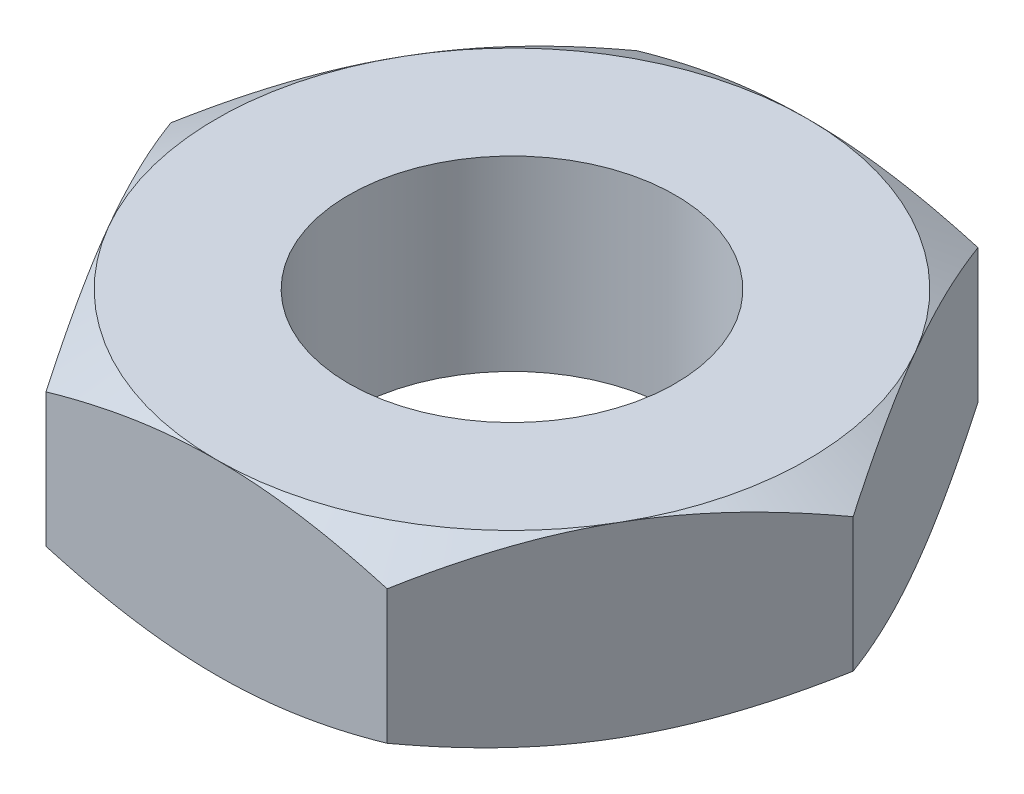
ISO-10303-21;
HEADER;
FILE_DESCRIPTION(('STEP AP214'),'2;1');
FILE_NAME('part.step','',(''),(''),'','','');
FILE_SCHEMA(('AUTOMOTIVE_DESIGN { 1 0 10303 214 1 1 1 1 }'));
ENDSEC;
DATA;
#1=APPLICATION_CONTEXT('core data for automotive mechanical design processes');
#2=APPLICATION_PROTOCOL_DEFINITION('international standard','automotive_design',2000,#1);
#3=PRODUCT_CONTEXT('',#1,'mechanical');
#4=PRODUCT('Part','Part','',(#3));
#5=PRODUCT_RELATED_PRODUCT_CATEGORY('part','',(#4));
#6=PRODUCT_DEFINITION_FORMATION('','',#4);
#7=PRODUCT_DEFINITION_CONTEXT('part definition',#1,'design');
#8=PRODUCT_DEFINITION('design','',#6,#7);
#9=PRODUCT_DEFINITION_SHAPE('','',#8);
#10=(LENGTH_UNIT() NAMED_UNIT(*) SI_UNIT(.MILLI.,.METRE.));
#11=(NAMED_UNIT(*) PLANE_ANGLE_UNIT() SI_UNIT($,.RADIAN.));
#12=(NAMED_UNIT(*) SI_UNIT($,.STERADIAN.) SOLID_ANGLE_UNIT());
#13=UNCERTAINTY_MEASURE_WITH_UNIT(LENGTH_MEASURE(1.E-05),#10,'distance_accuracy_value','');
#14=(GEOMETRIC_REPRESENTATION_CONTEXT(3) GLOBAL_UNCERTAINTY_ASSIGNED_CONTEXT((#13)) GLOBAL_UNIT_ASSIGNED_CONTEXT((#10,
#11,#12)) REPRESENTATION_CONTEXT('',''));
#15=CARTESIAN_POINT('',(0.,0.,0.));
#16=DIRECTION('',(0.,0.,1.));
#17=DIRECTION('',(1.,0.,0.));
#18=AXIS2_PLACEMENT_3D('',#15,#16,#17);
#19=CARTESIAN_POINT('',(-5.48482755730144,6.,9.5));
#20=DIRECTION('',(0.,0.,-1.));
#21=DIRECTION('',(-1.,0.,0.));
#22=AXIS2_PLACEMENT_3D('',#19,#20,#21);
#23=PLANE('',#22);
#24=CARTESIAN_POINT('',(-14.7068937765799,4.62362970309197,9.5));
#25=CARTESIAN_POINT('',(-14.4995501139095,4.52307626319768,9.5));
#26=CARTESIAN_POINT('',(-14.2919624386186,4.42302621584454,9.5));
#27=CARTESIAN_POINT('',(-13.8762481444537,4.2240469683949,9.5));
#28=CARTESIAN_POINT('',(-13.668121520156,4.12511777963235,9.5));
#29=CARTESIAN_POINT('',(-13.0428010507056,3.83015634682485,9.5));
#30=CARTESIAN_POINT('',(-12.6247283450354,3.635980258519,9.5));
#31=CARTESIAN_POINT('',(-11.7834887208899,3.25270589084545,9.5));
#32=CARTESIAN_POINT('',(-11.3603064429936,3.06364124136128,9.5));
#33=CARTESIAN_POINT('',(-10.5105677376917,2.69328067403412,9.5));
#34=CARTESIAN_POINT('',(-10.0840114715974,2.51198438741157,9.5));
#35=CARTESIAN_POINT('',(-9.21316108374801,2.15358539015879,9.5));
#36=CARTESIAN_POINT('',(-8.76873522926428,1.97680100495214,9.5));
#37=CARTESIAN_POINT('',(-7.87467550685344,1.63667478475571,9.5));
#38=CARTESIAN_POINT('',(-7.42504105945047,1.47333446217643,9.5));
#39=CARTESIAN_POINT('',(-6.52069340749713,1.16440435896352,9.5));
#40=CARTESIAN_POINT('',(-6.06599269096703,1.01877841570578,9.5));
#41=CARTESIAN_POINT('',(-5.15008524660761,0.749965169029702,9.5));
#42=CARTESIAN_POINT('',(-4.68888062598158,0.62677077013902,9.5));
#43=CARTESIAN_POINT('',(-3.76219051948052,0.409414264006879,9.5));
#44=CARTESIAN_POINT('',(-3.29674287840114,0.315095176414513,9.5));
#45=CARTESIAN_POINT('',(-2.59435369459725,0.19936734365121,9.5));
#46=CARTESIAN_POINT('',(-2.35950352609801,0.165081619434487,9.5));
#47=CARTESIAN_POINT('',(-1.88864471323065,0.105766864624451,9.5));
#48=CARTESIAN_POINT('',(-1.65263618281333,0.0807369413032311,9.5));
#49=CARTESIAN_POINT('',(-1.18284814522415,0.0407449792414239,9.5));
#50=CARTESIAN_POINT('',(-0.949079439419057,0.0256565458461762,9.5));
#51=CARTESIAN_POINT('',(-0.481113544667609,0.005376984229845,9.5));
#52=CARTESIAN_POINT('',(-0.24691636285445,0.000185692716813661,9.5));
#53=CARTESIAN_POINT('',(0.221488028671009,-0.000175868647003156,9.5));
#54=CARTESIAN_POINT('',(0.455695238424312,0.00465390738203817,9.5));
#55=CARTESIAN_POINT('',(0.923698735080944,0.0242170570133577,9.5));
#56=CARTESIAN_POINT('',(1.1574950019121,0.0389509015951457,9.5));
#57=CARTESIAN_POINT('',(1.72018105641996,0.086018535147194,9.5));
#58=CARTESIAN_POINT('',(2.04868096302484,0.123095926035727,9.5));
#59=CARTESIAN_POINT('',(2.70322743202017,0.214777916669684,9.5));
#60=CARTESIAN_POINT('',(3.02927365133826,0.269384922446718,9.5));
#61=CARTESIAN_POINT('',(3.67860756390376,0.394183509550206,9.5));
#62=CARTESIAN_POINT('',(4.00189287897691,0.46438734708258,9.5));
#63=CARTESIAN_POINT('',(4.64521294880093,0.61823863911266,9.5));
#64=CARTESIAN_POINT('',(4.96524775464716,0.701885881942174,9.5));
#65=CARTESIAN_POINT('',(5.60906657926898,0.882556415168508,9.5));
#66=CARTESIAN_POINT('',(5.9327791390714,0.979832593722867,9.5));
#67=CARTESIAN_POINT('',(6.57701512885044,1.18437377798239,9.5));
#68=CARTESIAN_POINT('',(6.89753853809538,1.29163884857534,9.5));
#69=CARTESIAN_POINT('',(7.53555549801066,1.51446014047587,9.5));
#70=CARTESIAN_POINT('',(7.85305003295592,1.63001355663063,9.5));
#71=CARTESIAN_POINT('',(8.4854126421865,1.86805820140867,9.5));
#72=CARTESIAN_POINT('',(8.80028074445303,1.99054935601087,9.5));
#73=CARTESIAN_POINT('',(9.53172443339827,2.28290021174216,9.5));
#74=CARTESIAN_POINT('',(9.94740386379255,2.4549983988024,9.5));
#75=CARTESIAN_POINT('',(10.7753143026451,2.80732159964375,9.5));
#76=CARTESIAN_POINT('',(11.1875451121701,2.98754707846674,9.5));
#77=CARTESIAN_POINT('',(12.0091844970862,3.35453048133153,9.5));
#78=CARTESIAN_POINT('',(12.4185924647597,3.54128976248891,9.5));
#79=CARTESIAN_POINT('',(13.2349605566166,3.92005059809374,9.5));
#80=CARTESIAN_POINT('',(13.6419207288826,4.11205204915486,9.5));
#81=CARTESIAN_POINT('',(14.454214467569,4.50053660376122,9.5));
#82=CARTESIAN_POINT('',(14.8595458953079,4.69702417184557,9.5));
#83=CARTESIAN_POINT('',(15.6684730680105,5.093538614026,9.5));
#84=CARTESIAN_POINT('',(16.0720688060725,5.29356550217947,9.5));
#85=CARTESIAN_POINT('',(17.2805625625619,5.89798249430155,9.5));
#86=CARTESIAN_POINT('',(18.083267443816,6.3067572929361,9.5));
#87=CARTESIAN_POINT('',(19.6191087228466,7.09890427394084,9.5));
#88=CARTESIAN_POINT('',(20.3525802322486,7.48162959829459,9.5));
#89=CARTESIAN_POINT('',(21.8167718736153,8.25236208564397,9.5));
#90=CARTESIAN_POINT('',(22.5474919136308,8.64036942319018,9.5));
#91=CARTESIAN_POINT('',(24.0050274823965,9.41948379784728,9.5));
#92=CARTESIAN_POINT('',(24.7318481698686,9.81058119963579,9.5));
#93=CARTESIAN_POINT('',(26.1837230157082,10.5959509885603,9.5));
#94=CARTESIAN_POINT('',(26.9087772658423,10.9902232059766,9.5));
#95=CARTESIAN_POINT('',(27.6331779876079,11.3856844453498,9.5));
#96=B_SPLINE_CURVE_WITH_KNOTS('',3,(#24,#25,#26,#27,#28,#29,#30,#31,#32,#33,#34,#35,#36,#37,#38,
#39,#40,#41,#42,#43,#44,#45,#46,#47,#48,#49,#50,#51,#52,#53,#54,#55,#56,#57,#58,#59,#60,#61,#62,
#63,#64,#65,#66,#67,#68,#69,#70,#71,#72,#73,#74,#75,#76,#77,#78,#79,#80,#81,#82,#83,#84,#85,#86,
#87,#88,#89,#90,#91,#92,#93,#94,#95),.UNSPECIFIED.,.F.,.F.,(4,2,2,2,2,2,2,2,2,2,2,2,2,2,2,2,2,2,
2,2,2,2,2,2,2,2,2,2,2,2,2,2,2,2,2,4),(0.,0.69131741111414,1.38264180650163,2.76549653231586,
4.15592398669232,5.54628536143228,6.98100468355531,8.4158851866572,9.84778549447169,
11.279232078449,12.7027524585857,13.414617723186,14.1264143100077,14.8289770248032,
15.5315281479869,16.2340824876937,16.9366702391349,17.9278783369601,18.9192225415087,
19.911348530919,20.9034589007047,21.9173037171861,22.9311551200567,23.9446649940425,
24.9581640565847,26.3077386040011,27.6573904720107,29.0073243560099,30.3572316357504,
31.7085465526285,33.0598668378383,35.7621733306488,38.2441116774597,40.7261322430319,
43.2022154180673,45.678167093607),.UNSPECIFIED.);
#97=CARTESIAN_POINT('',(5.48482755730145,0.848505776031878,9.5));
#98=VERTEX_POINT('',#97);
#99=CARTESIAN_POINT('',(0.,0.,9.5));
#100=VERTEX_POINT('',#99);
#101=EDGE_CURVE('E127',#98,#100,#96,.F.);
#102=ORIENTED_EDGE('',*,*,#101,.F.);
#103=DIRECTION('',(0.,-1.,0.));
#104=VECTOR('',#103,1.);
#105=CARTESIAN_POINT('',(5.48482755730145,6.,9.5));
#106=LINE('',#105,#104);
#107=CARTESIAN_POINT('',(5.48482755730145,5.15149422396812,9.5));
#108=VERTEX_POINT('',#107);
#109=EDGE_CURVE('E262',#108,#98,#106,.T.);
#110=ORIENTED_EDGE('',*,*,#109,.F.);
#111=CARTESIAN_POINT('',(-14.7068937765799,1.37637029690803,9.5));
#112=CARTESIAN_POINT('',(-14.4995501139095,1.47692373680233,9.5));
#113=CARTESIAN_POINT('',(-14.2919624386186,1.57697378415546,9.5));
#114=CARTESIAN_POINT('',(-13.8762481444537,1.7759530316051,9.5));
#115=CARTESIAN_POINT('',(-13.668121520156,1.87488222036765,9.5));
#116=CARTESIAN_POINT('',(-13.0428010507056,2.16984365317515,9.5));
#117=CARTESIAN_POINT('',(-12.6247283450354,2.364019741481,9.5));
#118=CARTESIAN_POINT('',(-11.7834887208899,2.74729410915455,9.5));
#119=CARTESIAN_POINT('',(-11.3603064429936,2.93635875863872,9.5));
#120=CARTESIAN_POINT('',(-10.5105677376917,3.30671932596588,9.5));
#121=CARTESIAN_POINT('',(-10.0840114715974,3.48801561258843,9.5));
#122=CARTESIAN_POINT('',(-9.21316108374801,3.84641460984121,9.5));
#123=CARTESIAN_POINT('',(-8.76873522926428,4.02319899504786,9.5));
#124=CARTESIAN_POINT('',(-7.87467550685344,4.36332521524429,9.5));
#125=CARTESIAN_POINT('',(-7.42504105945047,4.52666553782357,9.5));
#126=CARTESIAN_POINT('',(-6.52069340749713,4.83559564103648,9.5));
#127=CARTESIAN_POINT('',(-6.06599269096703,4.98122158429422,9.5));
#128=CARTESIAN_POINT('',(-5.15008524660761,5.2500348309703,9.5));
#129=CARTESIAN_POINT('',(-4.68888062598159,5.37322922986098,9.5));
#130=CARTESIAN_POINT('',(-3.76219051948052,5.59058573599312,9.5));
#131=CARTESIAN_POINT('',(-3.29674287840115,5.68490482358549,9.5));
#132=CARTESIAN_POINT('',(-2.59435369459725,5.80063265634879,9.5));
#133=CARTESIAN_POINT('',(-2.35950352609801,5.83491838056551,9.5));
#134=CARTESIAN_POINT('',(-1.88864471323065,5.89423313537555,9.5));
#135=CARTESIAN_POINT('',(-1.65263618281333,5.91926305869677,9.5));
#136=CARTESIAN_POINT('',(-1.18284814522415,5.95925502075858,9.5));
#137=CARTESIAN_POINT('',(-0.949079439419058,5.97434345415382,9.5));
#138=CARTESIAN_POINT('',(-0.48111354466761,5.99462301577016,9.5));
#139=CARTESIAN_POINT('',(-0.246916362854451,5.99981430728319,9.5));
#140=CARTESIAN_POINT('',(0.221488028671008,6.000175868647,9.5));
#141=CARTESIAN_POINT('',(0.455695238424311,5.99534609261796,9.5));
#142=CARTESIAN_POINT('',(0.923698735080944,5.97578294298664,9.5));
#143=CARTESIAN_POINT('',(1.1574950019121,5.96104909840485,9.5));
#144=CARTESIAN_POINT('',(1.72018105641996,5.91398146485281,9.5));
#145=CARTESIAN_POINT('',(2.04868096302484,5.87690407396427,9.5));
#146=CARTESIAN_POINT('',(2.70322743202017,5.78522208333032,9.5));
#147=CARTESIAN_POINT('',(3.02927365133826,5.73061507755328,9.5));
#148=CARTESIAN_POINT('',(3.67860756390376,5.6058164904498,9.5));
#149=CARTESIAN_POINT('',(4.00189287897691,5.53561265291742,9.5));
#150=CARTESIAN_POINT('',(4.64521294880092,5.38176136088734,9.5));
#151=CARTESIAN_POINT('',(4.96524775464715,5.29811411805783,9.5));
#152=CARTESIAN_POINT('',(5.60906657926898,5.11744358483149,9.5));
#153=CARTESIAN_POINT('',(5.9327791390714,5.02016740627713,9.5));
#154=CARTESIAN_POINT('',(6.57701512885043,4.81562622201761,9.5));
#155=CARTESIAN_POINT('',(6.89753853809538,4.70836115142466,9.5));
#156=CARTESIAN_POINT('',(7.53555549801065,4.48553985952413,9.5));
#157=CARTESIAN_POINT('',(7.85305003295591,4.36998644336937,9.5));
#158=CARTESIAN_POINT('',(8.4854126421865,4.13194179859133,9.5));
#159=CARTESIAN_POINT('',(8.80028074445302,4.00945064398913,9.5));
#160=CARTESIAN_POINT('',(9.53172443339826,3.71709978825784,9.5));
#161=CARTESIAN_POINT('',(9.94740386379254,3.54500160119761,9.5));
#162=CARTESIAN_POINT('',(10.7753143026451,3.19267840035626,9.5));
#163=CARTESIAN_POINT('',(11.1875451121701,3.01245292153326,9.5));
#164=CARTESIAN_POINT('',(12.0091844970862,2.64546951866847,9.5));
#165=CARTESIAN_POINT('',(12.4185924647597,2.45871023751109,9.5));
#166=CARTESIAN_POINT('',(13.2349605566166,2.07994940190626,9.5));
#167=CARTESIAN_POINT('',(13.6419207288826,1.88794795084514,9.5));
#168=CARTESIAN_POINT('',(14.454214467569,1.49946339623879,9.5));
#169=CARTESIAN_POINT('',(14.8595458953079,1.30297582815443,9.5));
#170=CARTESIAN_POINT('',(15.6684730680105,0.906461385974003,9.5));
#171=CARTESIAN_POINT('',(16.0720688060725,0.706434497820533,9.5));
#172=CARTESIAN_POINT('',(17.2805625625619,0.102017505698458,9.5));
#173=CARTESIAN_POINT('',(18.083267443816,-0.306757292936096,9.5));
#174=CARTESIAN_POINT('',(19.6191087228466,-1.09890427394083,9.5));
#175=CARTESIAN_POINT('',(20.3525802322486,-1.48162959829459,9.5));
#176=CARTESIAN_POINT('',(21.8167718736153,-2.25236208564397,9.5));
#177=CARTESIAN_POINT('',(22.5474919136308,-2.64036942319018,9.5));
#178=CARTESIAN_POINT('',(24.0050274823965,-3.41948379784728,9.5));
#179=CARTESIAN_POINT('',(24.7318481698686,-3.81058119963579,9.5));
#180=CARTESIAN_POINT('',(26.1837230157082,-4.59595098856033,9.5));
#181=CARTESIAN_POINT('',(26.9087772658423,-4.9902232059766,9.5));
#182=CARTESIAN_POINT('',(27.6331779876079,-5.38568444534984,9.5));
#183=B_SPLINE_CURVE_WITH_KNOTS('',3,(#111,#112,#113,#114,#115,#116,#117,#118,#119,#120,#121,
#122,#123,#124,#125,#126,#127,#128,#129,#130,#131,#132,#133,#134,#135,#136,#137,#138,#139,#140,
#141,#142,#143,#144,#145,#146,#147,#148,#149,#150,#151,#152,#153,#154,#155,#156,#157,#158,#159,
#160,#161,#162,#163,#164,#165,#166,#167,#168,#169,#170,#171,#172,#173,#174,#175,#176,#177,#178,
#179,#180,#181,#182),.UNSPECIFIED.,.F.,.F.,(4,2,2,2,2,2,2,2,2,2,2,2,2,2,2,2,2,2,2,2,2,2,2,2,2,2,
2,2,2,2,2,2,2,2,2,4),(0.,0.69131741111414,1.38264180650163,2.76549653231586,4.15592398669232,
5.54628536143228,6.98100468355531,8.4158851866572,9.84778549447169,11.279232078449,
12.7027524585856,13.414617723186,14.1264143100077,14.8289770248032,15.5315281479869,
16.2340824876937,16.9366702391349,17.9278783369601,18.9192225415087,19.911348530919,
20.9034589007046,21.9173037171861,22.9311551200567,23.9446649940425,24.9581640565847,
26.3077386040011,27.6573904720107,29.0073243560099,30.3572316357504,31.7085465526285,
33.0598668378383,35.7621733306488,38.2441116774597,40.7261322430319,43.2022154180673,
45.678167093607),.UNSPECIFIED.);
#184=CARTESIAN_POINT('',(0.,6.,9.5));
#185=VERTEX_POINT('',#184);
#186=EDGE_CURVE('E237',#185,#108,#183,.T.);
#187=ORIENTED_EDGE('',*,*,#186,.F.);
#188=CARTESIAN_POINT('',(-5.48482755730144,5.15149422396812,9.5));
#189=VERTEX_POINT('',#188);
#190=EDGE_CURVE('E243',#189,#185,#183,.T.);
#191=ORIENTED_EDGE('',*,*,#190,.F.);
#192=DIRECTION('',(0.,-1.,0.));
#193=VECTOR('',#192,1.);
#194=CARTESIAN_POINT('',(-5.48482755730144,6.,9.5));
#195=LINE('',#194,#193);
#196=CARTESIAN_POINT('',(-5.48482755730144,0.848505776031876,9.5));
#197=VERTEX_POINT('',#196);
#198=EDGE_CURVE('E158',#189,#197,#195,.T.);
#199=ORIENTED_EDGE('',*,*,#198,.T.);
#200=EDGE_CURVE('E140',#100,#197,#96,.F.);
#201=ORIENTED_EDGE('',*,*,#200,.F.);
#202=EDGE_LOOP('',(#102,#110,#187,#191,#199,#201));
#203=FACE_BOUND('',#202,.T.);
#204=ADVANCED_FACE('F37',(#203),#23,.F.);
#205=CARTESIAN_POINT('',(5.48482755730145,6.,9.5));
#206=DIRECTION('',(-0.866025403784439,0.,-0.5));
#207=DIRECTION('',(-0.5,0.,0.866025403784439));
#208=AXIS2_PLACEMENT_3D('',#205,#206,#207);
#209=PLANE('',#208);
#210=CARTESIAN_POINT('',(10.9697705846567,0.848572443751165,-0.000200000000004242));
#211=CARTESIAN_POINT('',(10.8492020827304,0.778973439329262,0.208630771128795));
#212=CARTESIAN_POINT('',(10.7281840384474,0.712533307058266,0.418240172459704));
#213=CARTESIAN_POINT('',(10.4851774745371,0.586847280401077,0.839139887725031));
#214=CARTESIAN_POINT('',(10.3631886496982,0.527603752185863,1.05043073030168));
#215=CARTESIAN_POINT('',(9.99525656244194,0.361814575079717,1.68770779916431));
#216=CARTESIAN_POINT('',(9.74786083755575,0.267514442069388,2.11620976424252));
#217=CARTESIAN_POINT('',(9.37764446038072,0.156938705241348,2.75744333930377));
#218=CARTESIAN_POINT('',(9.2559298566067,0.125439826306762,2.96825921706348));
#219=CARTESIAN_POINT('',(9.01193711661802,0.0726182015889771,3.39086703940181));
#220=CARTESIAN_POINT('',(8.88965896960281,0.0512956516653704,3.60265900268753));
#221=CARTESIAN_POINT('',(8.64489870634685,0.0193730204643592,4.02659621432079));
#222=CARTESIAN_POINT('',(8.52241700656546,0.00876019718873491,4.23874074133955));
#223=CARTESIAN_POINT('',(8.27734047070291,-0.00151746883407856,4.66322575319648));
#224=CARTESIAN_POINT('',(8.15474563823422,-0.00118264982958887,4.87556623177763));
#225=CARTESIAN_POINT('',(7.92555157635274,0.00967336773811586,5.27254199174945));
#226=CARTESIAN_POINT('',(7.81893617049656,0.0188702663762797,5.45720529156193));
#227=CARTESIAN_POINT('',(7.60595470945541,0.0453653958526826,5.82610000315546));
#228=CARTESIAN_POINT('',(7.49958867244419,0.0626641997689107,6.01033138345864));
#229=CARTESIAN_POINT('',(7.18090270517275,0.126304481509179,6.562311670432));
#230=CARTESIAN_POINT('',(6.96914687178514,0.184381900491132,6.92908353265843));
#231=CARTESIAN_POINT('',(6.5433889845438,0.329576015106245,7.66651782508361));
#232=CARTESIAN_POINT('',(6.32944126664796,0.417308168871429,8.03708614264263));
#233=CARTESIAN_POINT('',(5.90473630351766,0.616423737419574,8.77269671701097));
#234=CARTESIAN_POINT('',(5.69397361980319,0.727760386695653,9.137748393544));
#235=CARTESIAN_POINT('',(5.48471208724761,0.848572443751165,9.5002));
#236=B_SPLINE_CURVE_WITH_KNOTS('',3,(#210,#211,#212,#213,#214,#215,#216,#217,#218,#219,#220,
#221,#222,#223,#224,#225,#226,#227,#228,#229,#230,#231,#232,#233,#234,#235),.UNSPECIFIED.,.F.,
.F.,(4,2,2,2,2,2,2,2,2,2,2,2,4),(0.,0.752880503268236,1.50600787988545,3.0154687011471,
3.75167336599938,4.48789219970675,5.22323407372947,5.95855322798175,6.59868084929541,
7.23885375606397,8.52010929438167,9.82978009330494,11.1368800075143),.UNSPECIFIED.);
#237=CARTESIAN_POINT('',(10.9696551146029,0.848505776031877,0.));
#238=VERTEX_POINT('',#237);
#239=CARTESIAN_POINT('',(8.22724133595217,0.,4.74999999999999));
#240=VERTEX_POINT('',#239);
#241=EDGE_CURVE('E54',#238,#240,#236,.T.);
#242=ORIENTED_EDGE('',*,*,#241,.F.);
#243=DIRECTION('',(0.,-1.,0.));
#244=VECTOR('',#243,1.);
#245=CARTESIAN_POINT('',(10.9696551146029,6.,0.));
#246=LINE('',#245,#244);
#247=CARTESIAN_POINT('',(10.9696551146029,5.15149422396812,0.));
#248=VERTEX_POINT('',#247);
#249=EDGE_CURVE('E258',#248,#238,#246,.T.);
#250=ORIENTED_EDGE('',*,*,#249,.F.);
#251=CARTESIAN_POINT('',(5.48471208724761,5.15142755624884,9.5002));
#252=CARTESIAN_POINT('',(5.6052805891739,5.22102656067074,9.2913692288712));
#253=CARTESIAN_POINT('',(5.72629863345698,5.28746669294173,9.08175982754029));
#254=CARTESIAN_POINT('',(5.96930519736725,5.41315271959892,8.66086011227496));
#255=CARTESIAN_POINT('',(6.09129402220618,5.47239624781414,8.44956926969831));
#256=CARTESIAN_POINT('',(6.4592261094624,5.63818542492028,7.81229220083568));
#257=CARTESIAN_POINT('',(6.70662183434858,5.73248555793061,7.38379023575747));
#258=CARTESIAN_POINT('',(7.07683821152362,5.84306129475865,6.74255666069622));
#259=CARTESIAN_POINT('',(7.19855281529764,5.87456017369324,6.53174078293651));
#260=CARTESIAN_POINT('',(7.44254555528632,5.92738179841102,6.10913296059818));
#261=CARTESIAN_POINT('',(7.56482370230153,5.94870434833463,5.89734099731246));
#262=CARTESIAN_POINT('',(7.80958396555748,5.98062697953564,5.47340378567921));
#263=CARTESIAN_POINT('',(7.93206566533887,5.99123980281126,5.26125925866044));
#264=CARTESIAN_POINT('',(8.17714220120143,6.00151746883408,4.83677424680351));
#265=CARTESIAN_POINT('',(8.29973703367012,6.00118264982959,4.62443376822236));
#266=CARTESIAN_POINT('',(8.5289310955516,5.99032663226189,4.22745800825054));
#267=CARTESIAN_POINT('',(8.63554650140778,5.98112973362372,4.04279470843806));
#268=CARTESIAN_POINT('',(8.84852796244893,5.95463460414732,3.67389999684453));
#269=CARTESIAN_POINT('',(8.95489399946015,5.93733580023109,3.48966861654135));
#270=CARTESIAN_POINT('',(9.27357996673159,5.87369551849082,2.93768832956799));
#271=CARTESIAN_POINT('',(9.4853358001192,5.81561809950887,2.57091646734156));
#272=CARTESIAN_POINT('',(9.91109368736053,5.67042398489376,1.83348217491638));
#273=CARTESIAN_POINT('',(10.1250414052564,5.58269183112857,1.46291385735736));
#274=CARTESIAN_POINT('',(10.5497463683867,5.38357626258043,0.727303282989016));
#275=CARTESIAN_POINT('',(10.7605090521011,5.27223961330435,0.362251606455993));
#276=CARTESIAN_POINT('',(10.9697705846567,5.15142755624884,-0.00020000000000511));
#277=B_SPLINE_CURVE_WITH_KNOTS('',3,(#251,#252,#253,#254,#255,#256,#257,#258,#259,#260,#261,
#262,#263,#264,#265,#266,#267,#268,#269,#270,#271,#272,#273,#274,#275,#276),.UNSPECIFIED.,.F.,
.F.,(4,2,2,2,2,2,2,2,2,2,2,2,4),(0.,0.752880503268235,1.50600787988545,3.0154687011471,
3.75167336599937,4.48789219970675,5.22323407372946,5.95855322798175,6.59868084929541,
7.23885375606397,8.52010929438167,9.82978009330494,11.1368800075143),.UNSPECIFIED.);
#278=CARTESIAN_POINT('',(8.22724133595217,6.,4.74999999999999));
#279=VERTEX_POINT('',#278);
#280=EDGE_CURVE('E223',#279,#248,#277,.T.);
#281=ORIENTED_EDGE('',*,*,#280,.F.);
#282=EDGE_CURVE('E230',#108,#279,#277,.T.);
#283=ORIENTED_EDGE('',*,*,#282,.F.);
#284=ORIENTED_EDGE('',*,*,#109,.T.);
#285=EDGE_CURVE('E133',#240,#98,#236,.T.);
#286=ORIENTED_EDGE('',*,*,#285,.F.);
#287=EDGE_LOOP('',(#242,#250,#281,#283,#284,#286));
#288=FACE_BOUND('',#287,.T.);
#289=ADVANCED_FACE('F215',(#288),#209,.F.);
#290=CARTESIAN_POINT('',(10.9696551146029,6.,0.));
#291=DIRECTION('',(-0.866025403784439,0.,0.5));
#292=DIRECTION('',(0.5,0.,0.866025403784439));
#293=AXIS2_PLACEMENT_3D('',#290,#291,#292);
#294=PLANE('',#293);
#295=CARTESIAN_POINT('',(5.4847120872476,0.848572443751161,-9.5002));
#296=CARTESIAN_POINT('',(5.60528058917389,0.778973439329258,-9.2913692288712));
#297=CARTESIAN_POINT('',(5.72629863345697,0.712533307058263,-9.0817598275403));
#298=CARTESIAN_POINT('',(5.96930519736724,0.586847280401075,-8.66086011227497));
#299=CARTESIAN_POINT('',(6.09129402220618,0.527603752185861,-8.44956926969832));
#300=CARTESIAN_POINT('',(6.45922610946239,0.361814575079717,-7.81229220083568));
#301=CARTESIAN_POINT('',(6.70662183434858,0.267514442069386,-7.38379023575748));
#302=CARTESIAN_POINT('',(7.07683821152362,0.156938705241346,-6.74255666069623));
#303=CARTESIAN_POINT('',(7.19855281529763,0.12543982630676,-6.53174078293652));
#304=CARTESIAN_POINT('',(7.44254555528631,0.0726182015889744,-6.10913296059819));
#305=CARTESIAN_POINT('',(7.56482370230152,0.0512956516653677,-5.89734099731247));
#306=CARTESIAN_POINT('',(7.80958396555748,0.0193730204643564,-5.47340378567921));
#307=CARTESIAN_POINT('',(7.93206566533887,0.00876019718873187,-5.26125925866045));
#308=CARTESIAN_POINT('',(8.17714220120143,-0.00151746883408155,-4.83677424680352));
#309=CARTESIAN_POINT('',(8.29973703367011,-0.00118264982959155,-4.62443376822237));
#310=CARTESIAN_POINT('',(8.5289310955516,0.00967336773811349,-4.22745800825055));
#311=CARTESIAN_POINT('',(8.63554650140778,0.0188702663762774,-4.04279470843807));
#312=CARTESIAN_POINT('',(8.84852796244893,0.0453653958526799,-3.67389999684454));
#313=CARTESIAN_POINT('',(8.95489399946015,0.0626641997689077,-3.48966861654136));
#314=CARTESIAN_POINT('',(9.27357996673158,0.126304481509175,-2.937688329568));
#315=CARTESIAN_POINT('',(9.48533580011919,0.18438190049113,-2.57091646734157));
#316=CARTESIAN_POINT('',(9.91109368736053,0.329576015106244,-1.83348217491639));
#317=CARTESIAN_POINT('',(10.1250414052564,0.417308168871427,-1.46291385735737));
#318=CARTESIAN_POINT('',(10.5497463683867,0.616423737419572,-0.727303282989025));
#319=CARTESIAN_POINT('',(10.7605090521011,0.727760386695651,-0.362251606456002));
#320=CARTESIAN_POINT('',(10.9697705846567,0.848572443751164,0.00019999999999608));
#321=B_SPLINE_CURVE_WITH_KNOTS('',3,(#295,#296,#297,#298,#299,#300,#301,#302,#303,#304,#305,
#306,#307,#308,#309,#310,#311,#312,#313,#314,#315,#316,#317,#318,#319,#320),.UNSPECIFIED.,.F.,
.F.,(4,2,2,2,2,2,2,2,2,2,2,2,4),(0.,0.752880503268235,1.50600787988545,3.0154687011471,
3.75167336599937,4.48789219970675,5.22323407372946,5.95855322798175,6.59868084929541,
7.23885375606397,8.52010929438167,9.82978009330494,11.1368800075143),.UNSPECIFIED.);
#322=CARTESIAN_POINT('',(5.48482755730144,0.848505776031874,-9.5));
#323=VERTEX_POINT('',#322);
#324=CARTESIAN_POINT('',(8.22724133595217,0.,-4.75000000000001));
#325=VERTEX_POINT('',#324);
#326=EDGE_CURVE('E61',#323,#325,#321,.T.);
#327=ORIENTED_EDGE('',*,*,#326,.F.);
#328=DIRECTION('',(0.,-1.,0.));
#329=VECTOR('',#328,1.);
#330=CARTESIAN_POINT('',(5.48482755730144,6.,-9.5));
#331=LINE('',#330,#329);
#332=CARTESIAN_POINT('',(5.48482755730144,5.15149422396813,-9.5));
#333=VERTEX_POINT('',#332);
#334=EDGE_CURVE('E254',#333,#323,#331,.T.);
#335=ORIENTED_EDGE('',*,*,#334,.F.);
#336=CARTESIAN_POINT('',(10.9697705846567,5.15142755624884,0.000199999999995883));
#337=CARTESIAN_POINT('',(10.8492020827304,5.22102656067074,-0.208630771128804));
#338=CARTESIAN_POINT('',(10.7281840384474,5.28746669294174,-0.418240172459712));
#339=CARTESIAN_POINT('',(10.4851774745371,5.41315271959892,-0.839139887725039));
#340=CARTESIAN_POINT('',(10.3631886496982,5.47239624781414,-1.05043073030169));
#341=CARTESIAN_POINT('',(9.99525656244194,5.63818542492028,-1.68770779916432));
#342=CARTESIAN_POINT('',(9.74786083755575,5.73248555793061,-2.11620976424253));
#343=CARTESIAN_POINT('',(9.37764446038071,5.84306129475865,-2.75744333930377));
#344=CARTESIAN_POINT('',(9.2559298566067,5.87456017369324,-2.96825921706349));
#345=CARTESIAN_POINT('',(9.01193711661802,5.92738179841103,-3.39086703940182));
#346=CARTESIAN_POINT('',(8.88965896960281,5.94870434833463,-3.60265900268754));
#347=CARTESIAN_POINT('',(8.64489870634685,5.98062697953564,-4.02659621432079));
#348=CARTESIAN_POINT('',(8.52241700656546,5.99123980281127,-4.23874074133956));
#349=CARTESIAN_POINT('',(8.2773404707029,6.00151746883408,-4.66322575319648));
#350=CARTESIAN_POINT('',(8.15474563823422,6.00118264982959,-4.87556623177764));
#351=CARTESIAN_POINT('',(7.92555157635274,5.99032663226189,-5.27254199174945));
#352=CARTESIAN_POINT('',(7.81893617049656,5.98112973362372,-5.45720529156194));
#353=CARTESIAN_POINT('',(7.6059547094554,5.95463460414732,-5.82610000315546));
#354=CARTESIAN_POINT('',(7.49958867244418,5.93733580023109,-6.01033138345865));
#355=CARTESIAN_POINT('',(7.18090270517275,5.87369551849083,-6.562311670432));
#356=CARTESIAN_POINT('',(6.96914687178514,5.81561809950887,-6.92908353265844));
#357=CARTESIAN_POINT('',(6.5433889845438,5.67042398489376,-7.66651782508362));
#358=CARTESIAN_POINT('',(6.32944126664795,5.58269183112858,-8.03708614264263));
#359=CARTESIAN_POINT('',(5.90473630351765,5.38357626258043,-8.77269671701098));
#360=CARTESIAN_POINT('',(5.69397361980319,5.27223961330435,-9.137748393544));
#361=CARTESIAN_POINT('',(5.4847120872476,5.15142755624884,-9.5002));
#362=B_SPLINE_CURVE_WITH_KNOTS('',3,(#336,#337,#338,#339,#340,#341,#342,#343,#344,#345,#346,
#347,#348,#349,#350,#351,#352,#353,#354,#355,#356,#357,#358,#359,#360,#361),.UNSPECIFIED.,.F.,
.F.,(4,2,2,2,2,2,2,2,2,2,2,2,4),(0.,0.752880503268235,1.50600787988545,3.0154687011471,
3.75167336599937,4.48789219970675,5.22323407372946,5.95855322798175,6.59868084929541,
7.23885375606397,8.52010929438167,9.82978009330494,11.1368800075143),.UNSPECIFIED.);
#363=CARTESIAN_POINT('',(8.22724133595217,6.,-4.75000000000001));
#364=VERTEX_POINT('',#363);
#365=EDGE_CURVE('E232',#364,#333,#362,.T.);
#366=ORIENTED_EDGE('',*,*,#365,.F.);
#367=EDGE_CURVE('E231',#248,#364,#362,.T.);
#368=ORIENTED_EDGE('',*,*,#367,.F.);
#369=ORIENTED_EDGE('',*,*,#249,.T.);
#370=EDGE_CURVE('E209',#325,#238,#321,.T.);
#371=ORIENTED_EDGE('',*,*,#370,.F.);
#372=EDGE_LOOP('',(#327,#335,#366,#368,#369,#371));
#373=FACE_BOUND('',#372,.T.);
#374=ADVANCED_FACE('F218',(#373),#294,.F.);
#375=CARTESIAN_POINT('',(5.48482755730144,6.,-9.5));
#376=DIRECTION('',(0.,0.,1.));
#377=DIRECTION('',(1.,0.,0.));
#378=AXIS2_PLACEMENT_3D('',#375,#376,#377);
#379=PLANE('',#378);
#380=CARTESIAN_POINT('',(-14.7068937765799,4.62362970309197,-9.5));
#381=CARTESIAN_POINT('',(-14.4995501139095,4.52307626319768,-9.5));
#382=CARTESIAN_POINT('',(-14.2919624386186,4.42302621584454,-9.5));
#383=CARTESIAN_POINT('',(-13.8762481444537,4.2240469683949,-9.5));
#384=CARTESIAN_POINT('',(-13.668121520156,4.12511777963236,-9.5));
#385=CARTESIAN_POINT('',(-13.0428010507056,3.83015634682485,-9.5));
#386=CARTESIAN_POINT('',(-12.6247283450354,3.635980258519,-9.5));
#387=CARTESIAN_POINT('',(-11.7834887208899,3.25270589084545,-9.5));
#388=CARTESIAN_POINT('',(-11.3603064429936,3.06364124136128,-9.5));
#389=CARTESIAN_POINT('',(-10.5105677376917,2.69328067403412,-9.5));
#390=CARTESIAN_POINT('',(-10.0840114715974,2.51198438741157,-9.5));
#391=CARTESIAN_POINT('',(-9.21316108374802,2.15358539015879,-9.5));
#392=CARTESIAN_POINT('',(-8.76873522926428,1.97680100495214,-9.5));
#393=CARTESIAN_POINT('',(-7.87467550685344,1.63667478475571,-9.5));
#394=CARTESIAN_POINT('',(-7.42504105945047,1.47333446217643,-9.5));
#395=CARTESIAN_POINT('',(-6.52069340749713,1.16440435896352,-9.5));
#396=CARTESIAN_POINT('',(-6.06599269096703,1.01877841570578,-9.5));
#397=CARTESIAN_POINT('',(-5.15008524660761,0.749965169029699,-9.5));
#398=CARTESIAN_POINT('',(-4.68888062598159,0.626770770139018,-9.5));
#399=CARTESIAN_POINT('',(-3.76219051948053,0.409414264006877,-9.5));
#400=CARTESIAN_POINT('',(-3.29674287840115,0.315095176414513,-9.5));
#401=CARTESIAN_POINT('',(-2.59435369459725,0.199367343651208,-9.5));
#402=CARTESIAN_POINT('',(-2.35950352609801,0.165081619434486,-9.5));
#403=CARTESIAN_POINT('',(-1.88864471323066,0.105766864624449,-9.5));
#404=CARTESIAN_POINT('',(-1.65263618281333,0.0807369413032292,-9.5));
#405=CARTESIAN_POINT('',(-1.18284814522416,0.0407449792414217,-9.5));
#406=CARTESIAN_POINT('',(-0.949079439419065,0.0256565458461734,-9.5));
#407=CARTESIAN_POINT('',(-0.481113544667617,0.00537698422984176,-9.5));
#408=CARTESIAN_POINT('',(-0.246916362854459,0.000185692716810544,-9.5));
#409=CARTESIAN_POINT('',(0.221488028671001,-0.000175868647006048,-9.5));
#410=CARTESIAN_POINT('',(0.455695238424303,0.00465390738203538,-9.5));
#411=CARTESIAN_POINT('',(0.923698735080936,0.0242170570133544,-9.5));
#412=CARTESIAN_POINT('',(1.15749500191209,0.0389509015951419,-9.5));
#413=CARTESIAN_POINT('',(1.72018105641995,0.0860185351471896,-9.5));
#414=CARTESIAN_POINT('',(2.04868096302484,0.123095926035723,-9.5));
#415=CARTESIAN_POINT('',(2.70322743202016,0.21477791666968,-9.5));
#416=CARTESIAN_POINT('',(3.02927365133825,0.269384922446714,-9.5));
#417=CARTESIAN_POINT('',(3.67860756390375,0.394183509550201,-9.5));
#418=CARTESIAN_POINT('',(4.0018928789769,0.464387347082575,-9.5));
#419=CARTESIAN_POINT('',(4.64521294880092,0.618238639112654,-9.5));
#420=CARTESIAN_POINT('',(4.96524775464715,0.701885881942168,-9.5));
#421=CARTESIAN_POINT('',(5.60906657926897,0.882556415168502,-9.5));
#422=CARTESIAN_POINT('',(5.93277913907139,0.979832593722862,-9.5));
#423=CARTESIAN_POINT('',(6.57701512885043,1.18437377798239,-9.5));
#424=CARTESIAN_POINT('',(6.89753853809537,1.29163884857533,-9.5));
#425=CARTESIAN_POINT('',(7.53555549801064,1.51446014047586,-9.5));
#426=CARTESIAN_POINT('',(7.8530500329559,1.63001355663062,-9.5));
#427=CARTESIAN_POINT('',(8.48541264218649,1.86805820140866,-9.5));
#428=CARTESIAN_POINT('',(8.80028074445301,1.99054935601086,-9.5));
#429=CARTESIAN_POINT('',(9.53172443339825,2.28290021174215,-9.5));
#430=CARTESIAN_POINT('',(9.94740386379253,2.45499839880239,-9.5));
#431=CARTESIAN_POINT('',(10.7753143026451,2.80732159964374,-9.5));
#432=CARTESIAN_POINT('',(11.18754511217,2.98754707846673,-9.5));
#433=CARTESIAN_POINT('',(12.0091844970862,3.35453048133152,-9.5));
#434=CARTESIAN_POINT('',(12.4185924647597,3.5412897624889,-9.5));
#435=CARTESIAN_POINT('',(13.2349605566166,3.92005059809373,-9.5));
#436=CARTESIAN_POINT('',(13.6419207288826,4.11205204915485,-9.5));
#437=CARTESIAN_POINT('',(14.4542144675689,4.5005366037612,-9.5));
#438=CARTESIAN_POINT('',(14.8595458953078,4.69702417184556,-9.5));
#439=CARTESIAN_POINT('',(15.6684730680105,5.09353861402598,-9.5));
#440=CARTESIAN_POINT('',(16.0720688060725,5.29356550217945,-9.5));
#441=CARTESIAN_POINT('',(17.2805625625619,5.89798249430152,-9.5));
#442=CARTESIAN_POINT('',(18.083267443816,6.30675729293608,-9.5));
#443=CARTESIAN_POINT('',(19.6191087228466,7.09890427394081,-9.5));
#444=CARTESIAN_POINT('',(20.3525802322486,7.48162959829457,-9.5));
#445=CARTESIAN_POINT('',(21.8167718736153,8.25236208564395,-9.5));
#446=CARTESIAN_POINT('',(22.5474919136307,8.64036942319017,-9.5));
#447=CARTESIAN_POINT('',(24.0050274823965,9.41948379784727,-9.5));
#448=CARTESIAN_POINT('',(24.7318481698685,9.81058119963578,-9.5));
#449=CARTESIAN_POINT('',(26.1837230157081,10.5959509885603,-9.5));
#450=CARTESIAN_POINT('',(26.9087772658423,10.9902232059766,-9.5));
#451=CARTESIAN_POINT('',(27.6331779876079,11.3856844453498,-9.5));
#452=B_SPLINE_CURVE_WITH_KNOTS('',3,(#380,#381,#382,#383,#384,#385,#386,#387,#388,#389,#390,
#391,#392,#393,#394,#395,#396,#397,#398,#399,#400,#401,#402,#403,#404,#405,#406,#407,#408,#409,
#410,#411,#412,#413,#414,#415,#416,#417,#418,#419,#420,#421,#422,#423,#424,#425,#426,#427,#428,
#429,#430,#431,#432,#433,#434,#435,#436,#437,#438,#439,#440,#441,#442,#443,#444,#445,#446,#447,
#448,#449,#450,#451),.UNSPECIFIED.,.F.,.F.,(4,2,2,2,2,2,2,2,2,2,2,2,2,2,2,2,2,2,2,2,2,2,2,2,2,2,
2,2,2,2,2,2,2,2,2,4),(0.,0.691317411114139,1.38264180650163,2.76549653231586,4.15592398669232,
5.54628536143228,6.98100468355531,8.4158851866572,9.84778549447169,11.279232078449,
12.7027524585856,13.414617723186,14.1264143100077,14.8289770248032,15.5315281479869,
16.2340824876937,16.9366702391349,17.9278783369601,18.9192225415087,19.911348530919,
20.9034589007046,21.9173037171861,22.9311551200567,23.9446649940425,24.9581640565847,
26.3077386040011,27.6573904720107,29.0073243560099,30.3572316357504,31.7085465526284,
33.0598668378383,35.7621733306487,38.2441116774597,40.7261322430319,43.2022154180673,
45.678167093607),.UNSPECIFIED.);
#453=CARTESIAN_POINT('',(-5.48482755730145,0.848505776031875,-9.5));
#454=VERTEX_POINT('',#453);
#455=CARTESIAN_POINT('',(0.,0.,-9.50000000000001));
#456=VERTEX_POINT('',#455);
#457=EDGE_CURVE('E175',#454,#456,#452,.T.);
#458=ORIENTED_EDGE('',*,*,#457,.F.);
#459=DIRECTION('',(0.,-1.,0.));
#460=VECTOR('',#459,1.);
#461=CARTESIAN_POINT('',(-5.48482755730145,6.,-9.5));
#462=LINE('',#461,#460);
#463=CARTESIAN_POINT('',(-5.48482755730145,5.15149422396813,-9.5));
#464=VERTEX_POINT('',#463);
#465=EDGE_CURVE('E250',#464,#454,#462,.T.);
#466=ORIENTED_EDGE('',*,*,#465,.F.);
#467=CARTESIAN_POINT('',(-14.7068937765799,1.37637029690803,-9.5));
#468=CARTESIAN_POINT('',(-14.4995501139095,1.47692373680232,-9.5));
#469=CARTESIAN_POINT('',(-14.2919624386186,1.57697378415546,-9.5));
#470=CARTESIAN_POINT('',(-13.8762481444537,1.7759530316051,-9.5));
#471=CARTESIAN_POINT('',(-13.668121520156,1.87488222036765,-9.5));
#472=CARTESIAN_POINT('',(-13.0428010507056,2.16984365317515,-9.5));
#473=CARTESIAN_POINT('',(-12.6247283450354,2.364019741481,-9.5));
#474=CARTESIAN_POINT('',(-11.7834887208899,2.74729410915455,-9.5));
#475=CARTESIAN_POINT('',(-11.3603064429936,2.93635875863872,-9.5));
#476=CARTESIAN_POINT('',(-10.5105677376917,3.30671932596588,-9.5));
#477=CARTESIAN_POINT('',(-10.0840114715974,3.48801561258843,-9.5));
#478=CARTESIAN_POINT('',(-9.21316108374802,3.84641460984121,-9.5));
#479=CARTESIAN_POINT('',(-8.76873522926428,4.02319899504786,-9.5));
#480=CARTESIAN_POINT('',(-7.87467550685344,4.36332521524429,-9.5));
#481=CARTESIAN_POINT('',(-7.42504105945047,4.52666553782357,-9.5));
#482=CARTESIAN_POINT('',(-6.52069340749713,4.83559564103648,-9.5));
#483=CARTESIAN_POINT('',(-6.06599269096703,4.98122158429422,-9.5));
#484=CARTESIAN_POINT('',(-5.15008524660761,5.2500348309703,-9.5));
#485=CARTESIAN_POINT('',(-4.68888062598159,5.37322922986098,-9.5));
#486=CARTESIAN_POINT('',(-3.76219051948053,5.59058573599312,-9.5));
#487=CARTESIAN_POINT('',(-3.29674287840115,5.68490482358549,-9.5));
#488=CARTESIAN_POINT('',(-2.59435369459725,5.80063265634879,-9.5));
#489=CARTESIAN_POINT('',(-2.35950352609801,5.83491838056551,-9.5));
#490=CARTESIAN_POINT('',(-1.88864471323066,5.89423313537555,-9.5));
#491=CARTESIAN_POINT('',(-1.65263618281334,5.91926305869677,-9.5));
#492=CARTESIAN_POINT('',(-1.18284814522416,5.95925502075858,-9.5));
#493=CARTESIAN_POINT('',(-0.949079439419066,5.97434345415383,-9.5));
#494=CARTESIAN_POINT('',(-0.481113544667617,5.99462301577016,-9.5));
#495=CARTESIAN_POINT('',(-0.246916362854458,5.99981430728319,-9.5));
#496=CARTESIAN_POINT('',(0.221488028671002,6.00017586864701,-9.5));
#497=CARTESIAN_POINT('',(0.455695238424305,5.99534609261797,-9.5));
#498=CARTESIAN_POINT('',(0.923698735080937,5.97578294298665,-9.5));
#499=CARTESIAN_POINT('',(1.15749500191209,5.96104909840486,-9.5));
#500=CARTESIAN_POINT('',(1.72018105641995,5.91398146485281,-9.5));
#501=CARTESIAN_POINT('',(2.04868096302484,5.87690407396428,-9.5));
#502=CARTESIAN_POINT('',(2.70322743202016,5.78522208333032,-9.5));
#503=CARTESIAN_POINT('',(3.02927365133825,5.73061507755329,-9.5));
#504=CARTESIAN_POINT('',(3.67860756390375,5.6058164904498,-9.5));
#505=CARTESIAN_POINT('',(4.0018928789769,5.53561265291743,-9.5));
#506=CARTESIAN_POINT('',(4.64521294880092,5.38176136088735,-9.5));
#507=CARTESIAN_POINT('',(4.96524775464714,5.29811411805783,-9.5));
#508=CARTESIAN_POINT('',(5.60906657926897,5.1174435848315,-9.5));
#509=CARTESIAN_POINT('',(5.93277913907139,5.02016740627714,-9.5));
#510=CARTESIAN_POINT('',(6.57701512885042,4.81562622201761,-9.5));
#511=CARTESIAN_POINT('',(6.89753853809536,4.70836115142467,-9.5));
#512=CARTESIAN_POINT('',(7.53555549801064,4.48553985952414,-9.5));
#513=CARTESIAN_POINT('',(7.8530500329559,4.36998644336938,-9.5));
#514=CARTESIAN_POINT('',(8.48541264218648,4.13194179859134,-9.5));
#515=CARTESIAN_POINT('',(8.800280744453,4.00945064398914,-9.5));
#516=CARTESIAN_POINT('',(9.53172443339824,3.71709978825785,-9.5));
#517=CARTESIAN_POINT('',(9.94740386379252,3.54500160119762,-9.5));
#518=CARTESIAN_POINT('',(10.7753143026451,3.19267840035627,-9.5));
#519=CARTESIAN_POINT('',(11.18754511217,3.01245292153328,-9.5));
#520=CARTESIAN_POINT('',(12.0091844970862,2.64546951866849,-9.5));
#521=CARTESIAN_POINT('',(12.4185924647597,2.45871023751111,-9.5));
#522=CARTESIAN_POINT('',(13.2349605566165,2.07994940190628,-9.5));
#523=CARTESIAN_POINT('',(13.6419207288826,1.88794795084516,-9.5));
#524=CARTESIAN_POINT('',(14.4542144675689,1.4994633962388,-9.5));
#525=CARTESIAN_POINT('',(14.8595458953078,1.30297582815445,-9.5));
#526=CARTESIAN_POINT('',(15.6684730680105,0.906461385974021,-9.5));
#527=CARTESIAN_POINT('',(16.0720688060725,0.706434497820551,-9.5));
#528=CARTESIAN_POINT('',(17.2805625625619,0.102017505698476,-9.5));
#529=CARTESIAN_POINT('',(18.083267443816,-0.306757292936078,-9.5));
#530=CARTESIAN_POINT('',(19.6191087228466,-1.09890427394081,-9.5));
#531=CARTESIAN_POINT('',(20.3525802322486,-1.48162959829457,-9.5));
#532=CARTESIAN_POINT('',(21.8167718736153,-2.25236208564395,-9.5));
#533=CARTESIAN_POINT('',(22.5474919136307,-2.64036942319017,-9.5));
#534=CARTESIAN_POINT('',(24.0050274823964,-3.41948379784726,-9.5));
#535=CARTESIAN_POINT('',(24.7318481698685,-3.81058119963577,-9.5));
#536=CARTESIAN_POINT('',(26.1837230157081,-4.59595098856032,-9.5));
#537=CARTESIAN_POINT('',(26.9087772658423,-4.99022320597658,-9.5));
#538=CARTESIAN_POINT('',(27.6331779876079,-5.38568444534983,-9.5));
#539=B_SPLINE_CURVE_WITH_KNOTS('',3,(#467,#468,#469,#470,#471,#472,#473,#474,#475,#476,#477,
#478,#479,#480,#481,#482,#483,#484,#485,#486,#487,#488,#489,#490,#491,#492,#493,#494,#495,#496,
#497,#498,#499,#500,#501,#502,#503,#504,#505,#506,#507,#508,#509,#510,#511,#512,#513,#514,#515,
#516,#517,#518,#519,#520,#521,#522,#523,#524,#525,#526,#527,#528,#529,#530,#531,#532,#533,#534,
#535,#536,#537,#538),.UNSPECIFIED.,.F.,.F.,(4,2,2,2,2,2,2,2,2,2,2,2,2,2,2,2,2,2,2,2,2,2,2,2,2,2,
2,2,2,2,2,2,2,2,2,4),(0.,0.691317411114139,1.38264180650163,2.76549653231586,4.15592398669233,
5.54628536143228,6.98100468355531,8.4158851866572,9.84778549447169,11.279232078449,
12.7027524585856,13.414617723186,14.1264143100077,14.8289770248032,15.5315281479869,
16.2340824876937,16.9366702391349,17.9278783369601,18.9192225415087,19.911348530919,
20.9034589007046,21.917303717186,22.9311551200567,23.9446649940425,24.9581640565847,
26.3077386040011,27.6573904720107,29.0073243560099,30.3572316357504,31.7085465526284,
33.0598668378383,35.7621733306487,38.2441116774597,40.7261322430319,43.2022154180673,
45.678167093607),.UNSPECIFIED.);
#540=CARTESIAN_POINT('',(0.,6.,-9.50000000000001));
#541=VERTEX_POINT('',#540);
#542=EDGE_CURVE('E315',#541,#464,#539,.F.);
#543=ORIENTED_EDGE('',*,*,#542,.F.);
#544=EDGE_CURVE('E538',#333,#541,#539,.F.);
#545=ORIENTED_EDGE('',*,*,#544,.F.);
#546=ORIENTED_EDGE('',*,*,#334,.T.);
#547=EDGE_CURVE('E546',#456,#323,#452,.T.);
#548=ORIENTED_EDGE('',*,*,#547,.F.);
#549=EDGE_LOOP('',(#458,#466,#543,#545,#546,#548));
#550=FACE_BOUND('',#549,.T.);
#551=ADVANCED_FACE('F330',(#550),#379,.F.);
#552=CARTESIAN_POINT('',(-5.48482755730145,6.,-9.5));
#553=DIRECTION('',(0.866025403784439,0.,0.5));
#554=DIRECTION('',(0.5,0.,-0.866025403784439));
#555=AXIS2_PLACEMENT_3D('',#552,#553,#554);
#556=PLANE('',#555);
#557=CARTESIAN_POINT('',(-10.9697705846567,0.848572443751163,0.000199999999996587));
#558=CARTESIAN_POINT('',(-10.8492020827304,0.77897343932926,-0.208630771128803));
#559=CARTESIAN_POINT('',(-10.7281840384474,0.712533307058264,-0.418240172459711));
#560=CARTESIAN_POINT('',(-10.4851774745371,0.586847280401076,-0.839139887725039));
#561=CARTESIAN_POINT('',(-10.3631886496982,0.527603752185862,-1.05043073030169));
#562=CARTESIAN_POINT('',(-9.99525656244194,0.361814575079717,-1.68770779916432));
#563=CARTESIAN_POINT('',(-9.74786083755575,0.267514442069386,-2.11620976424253));
#564=CARTESIAN_POINT('',(-9.37764446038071,0.156938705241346,-2.75744333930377));
#565=CARTESIAN_POINT('',(-9.2559298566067,0.125439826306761,-2.96825921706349));
#566=CARTESIAN_POINT('',(-9.01193711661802,0.0726182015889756,-3.39086703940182));
#567=CARTESIAN_POINT('',(-8.88965896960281,0.0512956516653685,-3.60265900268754));
#568=CARTESIAN_POINT('',(-8.64489870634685,0.0193730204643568,-4.02659621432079));
#569=CARTESIAN_POINT('',(-8.52241700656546,0.00876019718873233,-4.23874074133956));
#570=CARTESIAN_POINT('',(-8.27734047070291,-0.0015174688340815,-4.66322575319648));
#571=CARTESIAN_POINT('',(-8.15474563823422,-0.00118264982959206,-4.87556623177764));
#572=CARTESIAN_POINT('',(-7.92555157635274,0.00967336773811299,-5.27254199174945));
#573=CARTESIAN_POINT('',(-7.81893617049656,0.0188702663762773,-5.45720529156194));
#574=CARTESIAN_POINT('',(-7.6059547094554,0.04536539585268,-5.82610000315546));
#575=CARTESIAN_POINT('',(-7.49958867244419,0.0626641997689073,-6.01033138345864));
#576=CARTESIAN_POINT('',(-7.18090270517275,0.126304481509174,-6.562311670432));
#577=CARTESIAN_POINT('',(-6.96914687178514,0.184381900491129,-6.92908353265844));
#578=CARTESIAN_POINT('',(-6.5433889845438,0.329576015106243,-7.66651782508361));
#579=CARTESIAN_POINT('',(-6.32944126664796,0.417308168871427,-8.03708614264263));
#580=CARTESIAN_POINT('',(-5.90473630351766,0.616423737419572,-8.77269671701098));
#581=CARTESIAN_POINT('',(-5.69397361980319,0.727760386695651,-9.13774839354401));
#582=CARTESIAN_POINT('',(-5.48471208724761,0.848572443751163,-9.5002));
#583=B_SPLINE_CURVE_WITH_KNOTS('',3,(#557,#558,#559,#560,#561,#562,#563,#564,#565,#566,#567,
#568,#569,#570,#571,#572,#573,#574,#575,#576,#577,#578,#579,#580,#581,#582),.UNSPECIFIED.,.F.,
.F.,(4,2,2,2,2,2,2,2,2,2,2,2,4),(0.,0.752880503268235,1.50600787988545,3.0154687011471,
3.75167336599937,4.48789219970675,5.22323407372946,5.95855322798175,6.5986808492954,
7.23885375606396,8.52010929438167,9.82978009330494,11.1368800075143),.UNSPECIFIED.);
#584=CARTESIAN_POINT('',(-10.9696551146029,0.848505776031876,0.));
#585=VERTEX_POINT('',#584);
#586=CARTESIAN_POINT('',(-8.22724133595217,0.,-4.75000000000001));
#587=VERTEX_POINT('',#586);
#588=EDGE_CURVE('E160',#585,#587,#583,.T.);
#589=ORIENTED_EDGE('',*,*,#588,.F.);
#590=DIRECTION('',(0.,-1.,0.));
#591=VECTOR('',#590,1.);
#592=CARTESIAN_POINT('',(-10.9696551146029,6.,0.));
#593=LINE('',#592,#591);
#594=CARTESIAN_POINT('',(-10.9696551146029,5.15149422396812,0.));
#595=VERTEX_POINT('',#594);
#596=EDGE_CURVE('E246',#595,#585,#593,.T.);
#597=ORIENTED_EDGE('',*,*,#596,.F.);
#598=CARTESIAN_POINT('',(-5.48471208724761,5.15142755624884,-9.5002));
#599=CARTESIAN_POINT('',(-5.6052805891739,5.22102656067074,-9.2913692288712));
#600=CARTESIAN_POINT('',(-5.72629863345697,5.28746669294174,-9.08175982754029));
#601=CARTESIAN_POINT('',(-5.96930519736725,5.41315271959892,-8.66086011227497));
#602=CARTESIAN_POINT('',(-6.09129402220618,5.47239624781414,-8.44956926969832));
#603=CARTESIAN_POINT('',(-6.45922610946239,5.63818542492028,-7.81229220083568));
#604=CARTESIAN_POINT('',(-6.70662183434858,5.73248555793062,-7.38379023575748));
#605=CARTESIAN_POINT('',(-7.07683821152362,5.84306129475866,-6.74255666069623));
#606=CARTESIAN_POINT('',(-7.19855281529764,5.87456017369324,-6.53174078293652));
#607=CARTESIAN_POINT('',(-7.44254555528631,5.92738179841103,-6.10913296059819));
#608=CARTESIAN_POINT('',(-7.56482370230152,5.94870434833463,-5.89734099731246));
#609=CARTESIAN_POINT('',(-7.80958396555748,5.98062697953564,-5.47340378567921));
#610=CARTESIAN_POINT('',(-7.93206566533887,5.99123980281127,-5.26125925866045));
#611=CARTESIAN_POINT('',(-8.17714220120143,6.00151746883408,-4.83677424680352));
#612=CARTESIAN_POINT('',(-8.29973703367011,6.00118264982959,-4.62443376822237));
#613=CARTESIAN_POINT('',(-8.5289310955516,5.99032663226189,-4.22745800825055));
#614=CARTESIAN_POINT('',(-8.63554650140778,5.98112973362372,-4.04279470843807));
#615=CARTESIAN_POINT('',(-8.84852796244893,5.95463460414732,-3.67389999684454));
#616=CARTESIAN_POINT('',(-8.95489399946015,5.93733580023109,-3.48966861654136));
#617=CARTESIAN_POINT('',(-9.27357996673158,5.87369551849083,-2.937688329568));
#618=CARTESIAN_POINT('',(-9.48533580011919,5.81561809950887,-2.57091646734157));
#619=CARTESIAN_POINT('',(-9.91109368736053,5.67042398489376,-1.83348217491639));
#620=CARTESIAN_POINT('',(-10.1250414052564,5.58269183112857,-1.46291385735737));
#621=CARTESIAN_POINT('',(-10.5497463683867,5.38357626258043,-0.727303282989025));
#622=CARTESIAN_POINT('',(-10.7605090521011,5.27223961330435,-0.362251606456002));
#623=CARTESIAN_POINT('',(-10.9697705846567,5.15142755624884,0.000199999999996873));
#624=B_SPLINE_CURVE_WITH_KNOTS('',3,(#598,#599,#600,#601,#602,#603,#604,#605,#606,#607,#608,
#609,#610,#611,#612,#613,#614,#615,#616,#617,#618,#619,#620,#621,#622,#623),.UNSPECIFIED.,.F.,
.F.,(4,2,2,2,2,2,2,2,2,2,2,2,4),(0.,0.752880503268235,1.50600787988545,3.0154687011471,
3.75167336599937,4.48789219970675,5.22323407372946,5.95855322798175,6.5986808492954,
7.23885375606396,8.52010929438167,9.82978009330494,11.1368800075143),.UNSPECIFIED.);
#625=CARTESIAN_POINT('',(-8.22724133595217,6.,-4.75000000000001));
#626=VERTEX_POINT('',#625);
#627=EDGE_CURVE('E302',#626,#595,#624,.T.);
#628=ORIENTED_EDGE('',*,*,#627,.F.);
#629=EDGE_CURVE('E305',#464,#626,#624,.T.);
#630=ORIENTED_EDGE('',*,*,#629,.F.);
#631=ORIENTED_EDGE('',*,*,#465,.T.);
#632=EDGE_CURVE('E139',#587,#454,#583,.T.);
#633=ORIENTED_EDGE('',*,*,#632,.F.);
#634=EDGE_LOOP('',(#589,#597,#628,#630,#631,#633));
#635=FACE_BOUND('',#634,.T.);
#636=ADVANCED_FACE('F304',(#635),#556,.F.);
#637=CARTESIAN_POINT('',(-10.9696551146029,6.,0.));
#638=DIRECTION('',(0.866025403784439,0.,-0.5));
#639=DIRECTION('',(-0.5,0.,-0.866025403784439));
#640=AXIS2_PLACEMENT_3D('',#637,#638,#639);
#641=PLANE('',#640);
#642=CARTESIAN_POINT('',(-5.4847120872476,0.848572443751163,9.5002));
#643=CARTESIAN_POINT('',(-5.60528058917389,0.778973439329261,9.2913692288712));
#644=CARTESIAN_POINT('',(-5.72629863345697,0.712533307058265,9.08175982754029));
#645=CARTESIAN_POINT('',(-5.96930519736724,0.586847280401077,8.66086011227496));
#646=CARTESIAN_POINT('',(-6.09129402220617,0.527603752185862,8.44956926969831));
#647=CARTESIAN_POINT('',(-6.45922610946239,0.361814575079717,7.81229220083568));
#648=CARTESIAN_POINT('',(-6.70662183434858,0.267514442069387,7.38379023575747));
#649=CARTESIAN_POINT('',(-7.07683821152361,0.156938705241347,6.74255666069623));
#650=CARTESIAN_POINT('',(-7.19855281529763,0.125439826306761,6.53174078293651));
#651=CARTESIAN_POINT('',(-7.44254555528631,0.0726182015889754,6.10913296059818));
#652=CARTESIAN_POINT('',(-7.56482370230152,0.0512956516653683,5.89734099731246));
#653=CARTESIAN_POINT('',(-7.80958396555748,0.0193730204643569,5.47340378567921));
#654=CARTESIAN_POINT('',(-7.93206566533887,0.00876019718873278,5.26125925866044));
#655=CARTESIAN_POINT('',(-8.17714220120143,-0.00151746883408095,4.83677424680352));
#656=CARTESIAN_POINT('',(-8.29973703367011,-0.00118264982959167,4.62443376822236));
#657=CARTESIAN_POINT('',(-8.5289310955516,0.00967336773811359,4.22745800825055));
#658=CARTESIAN_POINT('',(-8.63554650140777,0.0188702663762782,4.04279470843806));
#659=CARTESIAN_POINT('',(-8.84852796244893,0.0453653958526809,3.67389999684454));
#660=CARTESIAN_POINT('',(-8.95489399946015,0.0626641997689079,3.48966861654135));
#661=CARTESIAN_POINT('',(-9.27357996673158,0.126304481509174,2.937688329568));
#662=CARTESIAN_POINT('',(-9.48533580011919,0.184381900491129,2.57091646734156));
#663=CARTESIAN_POINT('',(-9.91109368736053,0.329576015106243,1.83348217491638));
#664=CARTESIAN_POINT('',(-10.1250414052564,0.417308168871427,1.46291385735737));
#665=CARTESIAN_POINT('',(-10.5497463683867,0.616423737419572,0.727303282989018));
#666=CARTESIAN_POINT('',(-10.7605090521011,0.727760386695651,0.362251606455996));
#667=CARTESIAN_POINT('',(-10.9697705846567,0.848572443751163,-0.000200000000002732));
#668=B_SPLINE_CURVE_WITH_KNOTS('',3,(#642,#643,#644,#645,#646,#647,#648,#649,#650,#651,#652,
#653,#654,#655,#656,#657,#658,#659,#660,#661,#662,#663,#664,#665,#666,#667),.UNSPECIFIED.,.F.,
.F.,(4,2,2,2,2,2,2,2,2,2,2,2,4),(0.,0.752880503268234,1.50600787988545,3.0154687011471,
3.75167336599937,4.48789219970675,5.22323407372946,5.95855322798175,6.59868084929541,
7.23885375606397,8.52010929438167,9.82978009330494,11.1368800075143),.UNSPECIFIED.);
#669=CARTESIAN_POINT('',(-8.22724133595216,0.,4.74999999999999));
#670=VERTEX_POINT('',#669);
#671=EDGE_CURVE('E146',#197,#670,#668,.T.);
#672=ORIENTED_EDGE('',*,*,#671,.F.);
#673=ORIENTED_EDGE('',*,*,#198,.F.);
#674=CARTESIAN_POINT('',(-10.9697705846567,5.15142755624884,-0.000200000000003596));
#675=CARTESIAN_POINT('',(-10.8492020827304,5.22102656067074,0.208630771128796));
#676=CARTESIAN_POINT('',(-10.7281840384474,5.28746669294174,0.418240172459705));
#677=CARTESIAN_POINT('',(-10.4851774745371,5.41315271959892,0.839139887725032));
#678=CARTESIAN_POINT('',(-10.3631886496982,5.47239624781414,1.05043073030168));
#679=CARTESIAN_POINT('',(-9.99525656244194,5.63818542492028,1.68770779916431));
#680=CARTESIAN_POINT('',(-9.74786083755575,5.73248555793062,2.11620976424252));
#681=CARTESIAN_POINT('',(-9.37764446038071,5.84306129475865,2.75744333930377));
#682=CARTESIAN_POINT('',(-9.2559298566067,5.87456017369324,2.96825921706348));
#683=CARTESIAN_POINT('',(-9.01193711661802,5.92738179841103,3.39086703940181));
#684=CARTESIAN_POINT('',(-8.88965896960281,5.94870434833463,3.60265900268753));
#685=CARTESIAN_POINT('',(-8.64489870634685,5.98062697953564,4.02659621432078));
#686=CARTESIAN_POINT('',(-8.52241700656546,5.99123980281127,4.23874074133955));
#687=CARTESIAN_POINT('',(-8.2773404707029,6.00151746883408,4.66322575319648));
#688=CARTESIAN_POINT('',(-8.15474563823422,6.00118264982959,4.87556623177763));
#689=CARTESIAN_POINT('',(-7.92555157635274,5.99032663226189,5.27254199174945));
#690=CARTESIAN_POINT('',(-7.81893617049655,5.98112973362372,5.45720529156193));
#691=CARTESIAN_POINT('',(-7.6059547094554,5.95463460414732,5.82610000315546));
#692=CARTESIAN_POINT('',(-7.49958867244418,5.93733580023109,6.01033138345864));
#693=CARTESIAN_POINT('',(-7.18090270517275,5.87369551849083,6.562311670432));
#694=CARTESIAN_POINT('',(-6.96914687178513,5.81561809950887,6.92908353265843));
#695=CARTESIAN_POINT('',(-6.5433889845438,5.67042398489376,7.66651782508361));
#696=CARTESIAN_POINT('',(-6.32944126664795,5.58269183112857,8.03708614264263));
#697=CARTESIAN_POINT('',(-5.90473630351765,5.38357626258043,8.77269671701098));
#698=CARTESIAN_POINT('',(-5.69397361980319,5.27223961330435,9.137748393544));
#699=CARTESIAN_POINT('',(-5.4847120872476,5.15142755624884,9.5002));
#700=B_SPLINE_CURVE_WITH_KNOTS('',3,(#674,#675,#676,#677,#678,#679,#680,#681,#682,#683,#684,
#685,#686,#687,#688,#689,#690,#691,#692,#693,#694,#695,#696,#697,#698,#699),.UNSPECIFIED.,.F.,
.F.,(4,2,2,2,2,2,2,2,2,2,2,2,4),(0.,0.752880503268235,1.50600787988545,3.0154687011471,
3.75167336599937,4.48789219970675,5.22323407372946,5.95855322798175,6.5986808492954,
7.23885375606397,8.52010929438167,9.82978009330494,11.1368800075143),.UNSPECIFIED.);
#701=CARTESIAN_POINT('',(-8.22724133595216,6.,4.74999999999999));
#702=VERTEX_POINT('',#701);
#703=EDGE_CURVE('E316',#702,#189,#700,.T.);
#704=ORIENTED_EDGE('',*,*,#703,.F.);
#705=EDGE_CURVE('E311',#595,#702,#700,.T.);
#706=ORIENTED_EDGE('',*,*,#705,.F.);
#707=ORIENTED_EDGE('',*,*,#596,.T.);
#708=EDGE_CURVE('E195',#670,#585,#668,.T.);
#709=ORIENTED_EDGE('',*,*,#708,.F.);
#710=EDGE_LOOP('',(#672,#673,#704,#706,#707,#709));
#711=FACE_BOUND('',#710,.T.);
#712=ADVANCED_FACE('F329',(#711),#641,.F.);
#713=CARTESIAN_POINT('',(0.,4.,0.));
#714=DIRECTION('',(0.,-1.,0.));
#715=DIRECTION('',(0.,0.,-1.));
#716=AXIS2_PLACEMENT_3D('',#713,#714,#715);
#717=CONICAL_SURFACE('',#716,12.9641016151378,1.0471975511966);
#718=ORIENTED_EDGE('',*,*,#190,.T.);
#719=CARTESIAN_POINT('',(0.,6.,0.));
#720=DIRECTION('',(0.,1.,0.));
#721=DIRECTION('',(0.,0.,1.));
#722=AXIS2_PLACEMENT_3D('',#719,#720,#721);
#723=CIRCLE('',#722,9.5);
#724=EDGE_CURVE('E264',#702,#185,#723,.T.);
#725=ORIENTED_EDGE('',*,*,#724,.F.);
#726=ORIENTED_EDGE('',*,*,#703,.T.);
#727=EDGE_LOOP('',(#718,#725,#726));
#728=FACE_BOUND('',#727,.T.);
#729=ADVANCED_FACE('F190',(#728),#717,.T.);
#730=ORIENTED_EDGE('',*,*,#627,.T.);
#731=ORIENTED_EDGE('',*,*,#705,.T.);
#732=EDGE_CURVE('E267',#626,#702,#723,.T.);
#733=ORIENTED_EDGE('',*,*,#732,.F.);
#734=EDGE_LOOP('',(#730,#731,#733));
#735=FACE_BOUND('',#734,.T.);
#736=ADVANCED_FACE('F374',(#735),#717,.T.);
#737=ORIENTED_EDGE('',*,*,#542,.T.);
#738=ORIENTED_EDGE('',*,*,#629,.T.);
#739=EDGE_CURVE('E274',#541,#626,#723,.T.);
#740=ORIENTED_EDGE('',*,*,#739,.F.);
#741=EDGE_LOOP('',(#737,#738,#740));
#742=FACE_BOUND('',#741,.T.);
#743=ADVANCED_FACE('F383',(#742),#717,.T.);
#744=ORIENTED_EDGE('',*,*,#365,.T.);
#745=ORIENTED_EDGE('',*,*,#544,.T.);
#746=CARTESIAN_POINT('',(0.,6.,0.));
#747=DIRECTION('',(0.,-1.,0.));
#748=DIRECTION('',(0.,0.,-1.));
#749=AXIS2_PLACEMENT_3D('',#746,#747,#748);
#750=CIRCLE('',#749,9.5);
#751=EDGE_CURVE('E296',#541,#364,#750,.T.);
#752=ORIENTED_EDGE('',*,*,#751,.T.);
#753=EDGE_LOOP('',(#744,#745,#752));
#754=FACE_BOUND('',#753,.T.);
#755=ADVANCED_FACE('F390',(#754),#717,.T.);
#756=ORIENTED_EDGE('',*,*,#280,.T.);
#757=ORIENTED_EDGE('',*,*,#367,.T.);
#758=EDGE_CURVE('E276',#279,#364,#723,.T.);
#759=ORIENTED_EDGE('',*,*,#758,.F.);
#760=EDGE_LOOP('',(#756,#757,#759));
#761=FACE_BOUND('',#760,.T.);
#762=ADVANCED_FACE('F397',(#761),#717,.T.);
#763=ORIENTED_EDGE('',*,*,#186,.T.);
#764=ORIENTED_EDGE('',*,*,#282,.T.);
#765=EDGE_CURVE('E152',#185,#279,#723,.T.);
#766=ORIENTED_EDGE('',*,*,#765,.F.);
#767=EDGE_LOOP('',(#763,#764,#766));
#768=FACE_BOUND('',#767,.T.);
#769=ADVANCED_FACE('F376',(#768),#717,.T.);
#770=CARTESIAN_POINT('',(5.48482755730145,6.,9.5));
#771=DIRECTION('',(0.,1.,0.));
#772=DIRECTION('',(0.,0.,1.));
#773=AXIS2_PLACEMENT_3D('',#770,#771,#772);
#774=PLANE('',#773);
#775=CARTESIAN_POINT('',(0.,6.,0.));
#776=DIRECTION('',(0.,1.,0.));
#777=DIRECTION('',(0.,0.,1.));
#778=AXIS2_PLACEMENT_3D('',#775,#776,#777);
#779=CIRCLE('',#778,5.25);
#780=CARTESIAN_POINT('',(0.,6.,5.25));
#781=VERTEX_POINT('',#780);
#782=EDGE_CURVE('E525',#781,#781,#779,.T.);
#783=ORIENTED_EDGE('',*,*,#782,.F.);
#784=EDGE_LOOP('',(#783));
#785=FACE_BOUND('',#784,.T.);
#786=ORIENTED_EDGE('',*,*,#724,.T.);
#787=ORIENTED_EDGE('',*,*,#765,.T.);
#788=ORIENTED_EDGE('',*,*,#758,.T.);
#789=ORIENTED_EDGE('',*,*,#751,.F.);
#790=ORIENTED_EDGE('',*,*,#739,.T.);
#791=ORIENTED_EDGE('',*,*,#732,.T.);
#792=EDGE_LOOP('',(#786,#787,#788,#789,#790,#791));
#793=FACE_BOUND('',#792,.T.);
#794=ADVANCED_FACE('F293',(#785,#793),#774,.T.);
#795=CARTESIAN_POINT('',(0.,0.,0.));
#796=DIRECTION('',(0.,1.,0.));
#797=DIRECTION('',(0.,0.,1.));
#798=AXIS2_PLACEMENT_3D('',#795,#796,#797);
#799=CONICAL_SURFACE('',#798,9.5,1.0471975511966);
#800=ORIENTED_EDGE('',*,*,#200,.T.);
#801=ORIENTED_EDGE('',*,*,#671,.T.);
#802=CARTESIAN_POINT('',(0.,0.,0.));
#803=DIRECTION('',(0.,1.,0.));
#804=DIRECTION('',(0.,0.,1.));
#805=AXIS2_PLACEMENT_3D('',#802,#803,#804);
#806=CIRCLE('',#805,9.5);
#807=EDGE_CURVE('E41',#670,#100,#806,.T.);
#808=ORIENTED_EDGE('',*,*,#807,.T.);
#809=EDGE_LOOP('',(#800,#801,#808));
#810=FACE_BOUND('',#809,.T.);
#811=ADVANCED_FACE('F144',(#810),#799,.T.);
#812=ORIENTED_EDGE('',*,*,#588,.T.);
#813=EDGE_CURVE('E151',#587,#670,#806,.T.);
#814=ORIENTED_EDGE('',*,*,#813,.T.);
#815=ORIENTED_EDGE('',*,*,#708,.T.);
#816=EDGE_LOOP('',(#812,#814,#815));
#817=FACE_BOUND('',#816,.T.);
#818=ADVANCED_FACE('F188',(#817),#799,.T.);
#819=ORIENTED_EDGE('',*,*,#457,.T.);
#820=EDGE_CURVE('E549',#456,#587,#806,.T.);
#821=ORIENTED_EDGE('',*,*,#820,.T.);
#822=ORIENTED_EDGE('',*,*,#632,.T.);
#823=EDGE_LOOP('',(#819,#821,#822));
#824=FACE_BOUND('',#823,.T.);
#825=ADVANCED_FACE('F187',(#824),#799,.T.);
#826=ORIENTED_EDGE('',*,*,#326,.T.);
#827=CARTESIAN_POINT('',(0.,0.,0.));
#828=DIRECTION('',(0.,-1.,0.));
#829=DIRECTION('',(0.,0.,-1.));
#830=AXIS2_PLACEMENT_3D('',#827,#828,#829);
#831=CIRCLE('',#830,9.5);
#832=EDGE_CURVE('E528',#456,#325,#831,.T.);
#833=ORIENTED_EDGE('',*,*,#832,.F.);
#834=ORIENTED_EDGE('',*,*,#547,.T.);
#835=EDGE_LOOP('',(#826,#833,#834));
#836=FACE_BOUND('',#835,.T.);
#837=ADVANCED_FACE('F181',(#836),#799,.T.);
#838=ORIENTED_EDGE('',*,*,#370,.T.);
#839=ORIENTED_EDGE('',*,*,#241,.T.);
#840=EDGE_CURVE('E47',#240,#325,#806,.T.);
#841=ORIENTED_EDGE('',*,*,#840,.T.);
#842=EDGE_LOOP('',(#838,#839,#841));
#843=FACE_BOUND('',#842,.T.);
#844=ADVANCED_FACE('F186',(#843),#799,.T.);
#845=ORIENTED_EDGE('',*,*,#285,.T.);
#846=ORIENTED_EDGE('',*,*,#101,.T.);
#847=EDGE_CURVE('E11',#100,#240,#806,.T.);
#848=ORIENTED_EDGE('',*,*,#847,.T.);
#849=EDGE_LOOP('',(#845,#846,#848));
#850=FACE_BOUND('',#849,.T.);
#851=ADVANCED_FACE('F129',(#850),#799,.T.);
#852=CARTESIAN_POINT('',(5.48482755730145,0.,9.5));
#853=DIRECTION('',(0.,1.,0.));
#854=DIRECTION('',(0.,0.,1.));
#855=AXIS2_PLACEMENT_3D('',#852,#853,#854);
#856=PLANE('',#855);
#857=CARTESIAN_POINT('',(0.,0.,0.));
#858=DIRECTION('',(0.,1.,0.));
#859=DIRECTION('',(0.,0.,1.));
#860=AXIS2_PLACEMENT_3D('',#857,#858,#859);
#861=CIRCLE('',#860,5.25);
#862=CARTESIAN_POINT('',(0.,0.,5.25));
#863=VERTEX_POINT('',#862);
#864=EDGE_CURVE('E522',#863,#863,#861,.T.);
#865=ORIENTED_EDGE('',*,*,#864,.T.);
#866=EDGE_LOOP('',(#865));
#867=FACE_BOUND('',#866,.T.);
#868=ORIENTED_EDGE('',*,*,#847,.F.);
#869=ORIENTED_EDGE('',*,*,#807,.F.);
#870=ORIENTED_EDGE('',*,*,#813,.F.);
#871=ORIENTED_EDGE('',*,*,#820,.F.);
#872=ORIENTED_EDGE('',*,*,#832,.T.);
#873=ORIENTED_EDGE('',*,*,#840,.F.);
#874=EDGE_LOOP('',(#868,#869,#870,#871,#872,#873));
#875=FACE_BOUND('',#874,.T.);
#876=ADVANCED_FACE('F153',(#867,#875),#856,.F.);
#877=CARTESIAN_POINT('',(0.,6.,0.));
#878=DIRECTION('',(0.,1.,0.));
#879=DIRECTION('',(0.,0.,1.));
#880=AXIS2_PLACEMENT_3D('',#877,#878,#879);
#881=CYLINDRICAL_SURFACE('',#880,5.25);
#882=ORIENTED_EDGE('',*,*,#864,.F.);
#883=EDGE_LOOP('',(#882));
#884=FACE_BOUND('',#883,.T.);
#885=ORIENTED_EDGE('',*,*,#782,.T.);
#886=EDGE_LOOP('',(#885));
#887=FACE_BOUND('',#886,.T.);
#888=ADVANCED_FACE('F189',(#884,#887),#881,.F.);
#889=CLOSED_SHELL('',(#204,#289,#374,#551,#636,#712,#729,#736,#743,#755,#762,#769,#794,#811,
#818,#825,#837,#844,#851,#876,#888));
#890=MANIFOLD_SOLID_BREP('B2',#889);
#891=ADVANCED_BREP_SHAPE_REPRESENTATION('',(#18,#890),#14);
#892=SHAPE_DEFINITION_REPRESENTATION(#9,#891);
ENDSEC;
END-ISO-10303-21;
